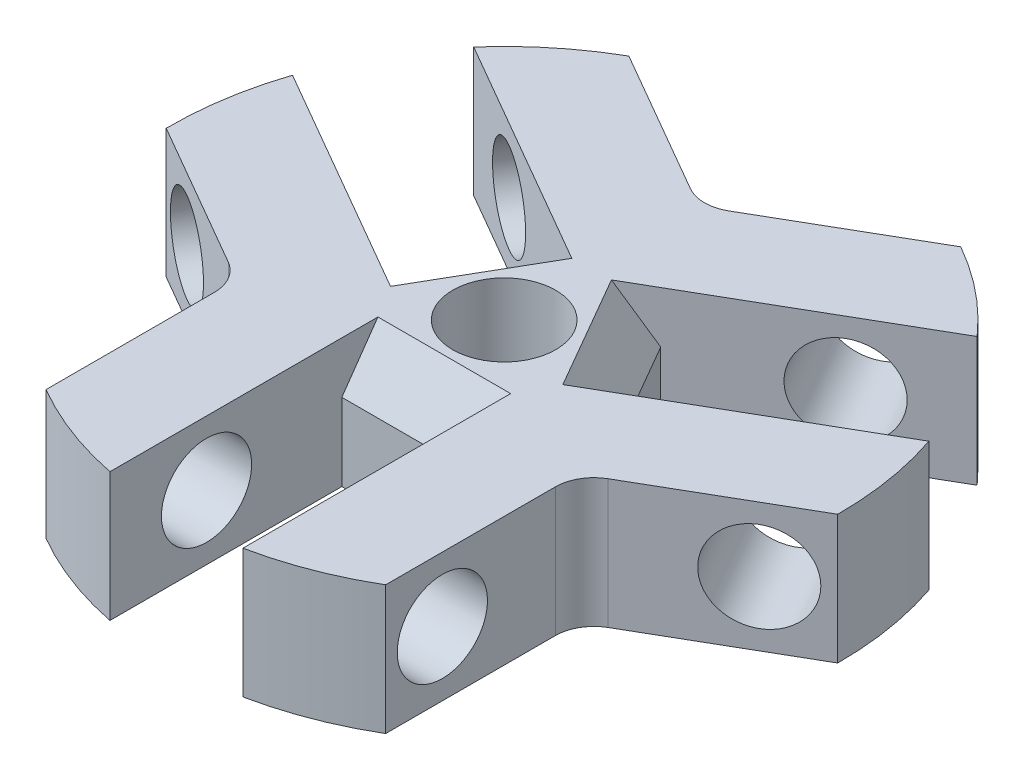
from build123d import *
from OCP.BRepFilletAPI import BRepFilletAPI_MakeChamfer

# Parameters (mm, degrees)
SKETCH2_W                       = 5.15
SKETCH2_H                       = 11
CUT_EXTRUDE1_DEPTH              = 10
SKETCH3_R                       = 1.5
CUT_EXTRUDE2_DEPTH              = 20.052558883
CIRPATTERN1_COUNT               = 3
CUT_EXTRUDE3_START              = -10
CUT_EXTRUDE3_DEPTH              = 10
FILLET2_R                       = 1.5
CIRPATTERN2_COUNT               = 3
FILLET2_OF_CIRPATTERN2_R        = 1.5
SKETCH5_R                       = 1.75
CUT_EXTRUDE4_DEPTH              = 25.051522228
CIRPATTERN3_COUNT               = 3
CHAMFER4_SIZE                   = 2
CHAMFER4_SIZE2                  = 1.400415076
M4X0_7_TAPPED_HOLE1_D           = 3.3
M4X0_7_TAPPED_HOLE1_CBORE_D     = 4
M4X0_7_TAPPED_HOLE1_CBORE_DEPTH = 8


with BuildPart() as part:
    # Sketch1 → Base-Revolve (revolve)
    with BuildSketch(Plane.XY, mode=Mode.PRIVATE) as base_revolve_sk:
        Polygon((-2, 0), (-2, 1), (0, 1), (0, 5), (-13, 5), (-13, 0), align=None)
    revolve(base_revolve_sk.sketch.rotate(Axis((0, 0, 0), (0, 1, 0)), 270), axis=Axis((0, 0, 0), (0, 1, 0)))

    # Sketch2 → Cut-Extrude1 (cut)
    with BuildSketch(Plane(origin=(0, 5, 0), x_dir=(-1, 0, 0), z_dir=(0, 1, 0))):
        with Locations((-0.025, 9.25)):
            Rectangle(SKETCH2_W, SKETCH2_H)
    cut_extrude1 = extrude(amount=-CUT_EXTRUDE1_DEPTH, mode=Mode.SUBTRACT)

    # Sketch3 → Cut-Extrude2 (cut, through all)
    with BuildSketch(Plane(origin=(0, 5, 0), x_dir=(-1, 0, 0), z_dir=(0, 1, 0))):
        with Locations(Location((0, 0, 0), (0, 0, 90))):
            Circle(SKETCH3_R)
    extrude(amount=-CUT_EXTRUDE2_DEPTH, mode=Mode.SUBTRACT)

    # CirPattern1: Cut-Extrude1 ×3 about axis
    cirpattern1_axis = Axis((0, 0, 0), (0, 1, 0))
    for i in range(1, CIRPATTERN1_COUNT):
        add(cut_extrude1.rotate(cirpattern1_axis, i * 360 / CIRPATTERN1_COUNT), mode=Mode.SUBTRACT)

    # Sketch4 → Cut-Extrude3 (cut)
    with BuildSketch(Plane(origin=(0, 5, 0), x_dir=(-1, 0, 0), z_dir=(0, 1, 0)).offset(CUT_EXTRUDE3_START)):
        with BuildLine():
            Line((-12.999871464, 0.057809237), (-6.6, 3.75277675))
            Line((-6.6, 3.75277675), (-6.6, 11.2))
            ThreePointArc((-6.6, 11.2), (-11.272792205, 6.474886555), (-12.999871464, 0.057809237))
        make_face()
    cut_extrude3 = extrude(amount=CUT_EXTRUDE3_DEPTH, mode=Mode.SUBTRACT)

    # Fillet2
    fillet2_edges = [part.edges().sort_by_distance(p)[0] for p in [
        (6.6, 2.5, 3.75277675),
    ]]
    fillet(fillet2_edges, radius=FILLET2_R)

    # CirPattern2: Cut-Extrude3 ×3 about axis
    cirpattern2_axis = Axis((0, 0, 0), (0, 1, 0))
    for i in range(1, CIRPATTERN2_COUNT):
        add(cut_extrude3.rotate(cirpattern2_axis, i * 360 / CIRPATTERN2_COUNT), mode=Mode.SUBTRACT)

    # Fillet2 of CirPattern2
    fillet2_of_cirpattern2_edges = [part.edges().sort_by_distance(p)[0] for p in [
        (-0.05, 2.5, -7.59215604),
        (-6.55, 2.5, 3.83937929),
    ]]
    fillet(fillet2_of_cirpattern2_edges, radius=FILLET2_OF_CIRPATTERN2_R)

    # Sketch5 → Cut-Extrude4 (cut, through all)
    with BuildSketch(Plane(origin=(3.275, 0, 5.672466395), x_dir=(0.8660254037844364, 0, -0.5000000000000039), z_dir=(0.5000000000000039, 0, 0.8660254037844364))):
        with Locations((9, 2.5)):
            Circle(SKETCH5_R)
    cut_extrude4 = extrude(amount=-CUT_EXTRUDE4_DEPTH, mode=Mode.SUBTRACT)

    # CirPattern3: Cut-Extrude4 ×3 about axis
    cirpattern3_axis = Axis((0, 0, 0), (0, 1, 0))
    for i in range(1, CIRPATTERN3_COUNT):
        add(cut_extrude4.rotate(cirpattern3_axis, i * 360 / CIRPATTERN3_COUNT), mode=Mode.SUBTRACT)

    # Chamfer4: one chamfer whose edges measure the first distance from different faces: ONE call of the kernel's chamfer builder (chamfer() names one face for all edges)
    chamfer4_edges_1 = [part.edges().sort_by_distance(p)[0] for p in [
        (0.025, 5, 3.75),
    ]]
    chamfer4_side_1 = [part.faces().sort_by_distance(p)[0] for p in [
        (0.025, 2.5, 3.75),
    ]]
    chamfer4_edges_2 = [part.edges().sort_by_distance(p)[0] for p in [
        (3.235095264, 5, -1.896650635),
    ]]
    chamfer4_side_2 = [part.faces().sort_by_distance(p)[0] for p in [
        (3.235095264, 2.5, -1.896650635),
    ]]
    chamfer4_edges_3 = [part.edges().sort_by_distance(p)[0] for p in [
        (-3.260095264, 5, -1.853349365),
    ]]
    chamfer4_side_3 = [part.faces().sort_by_distance(p)[0] for p in [
        (-3.260095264, 2.5, -1.853349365),
    ]]
    chamfer4 = BRepFilletAPI_MakeChamfer(part.part.solid().wrapped)
    for e in chamfer4_edges_1:
        chamfer4.Add(CHAMFER4_SIZE, CHAMFER4_SIZE2, e.wrapped, chamfer4_side_1[0].wrapped)  # the first distance lies on this face
    for e in chamfer4_edges_2:
        chamfer4.Add(CHAMFER4_SIZE, CHAMFER4_SIZE2, e.wrapped, chamfer4_side_2[0].wrapped)  # the first distance lies on this face
    for e in chamfer4_edges_3:
        chamfer4.Add(CHAMFER4_SIZE, CHAMFER4_SIZE2, e.wrapped, chamfer4_side_3[0].wrapped)  # the first distance lies on this face
    add(Compound.cast(chamfer4.Shape()), mode=Mode.REPLACE)

    # M4x0.7 Tapped Hole1 (through all)
    with Locations(Plane(origin=(0, 5, 0), x_dir=(-1, 0, 0), z_dir=(0, 1, 0))):
        with Locations((0, 0)):
            CounterBoreHole(M4X0_7_TAPPED_HOLE1_D / 2, M4X0_7_TAPPED_HOLE1_CBORE_D / 2, M4X0_7_TAPPED_HOLE1_CBORE_DEPTH)


solid = part.part
